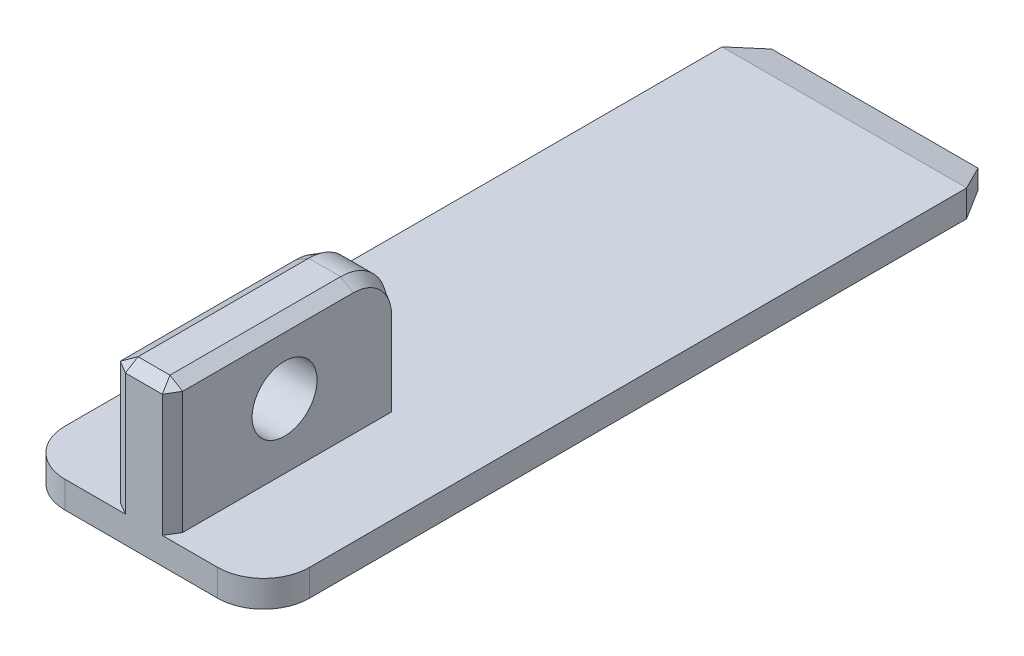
from build123d import *
from OCP.BRepFilletAPI import BRepFilletAPI_MakeChamfer

# Parameters (mm, degrees)
SKIZZE1_W                       = 32
SKIZZE1_H                       = 3.5
AUFSATZ_LINEAR_AUSTRAGEN1_DEPTH = 96
FASE1_SIZE                      = 2.5
FASE1_SIZE2                     = 4
FASE2_SIZE                      = 1
FASE2_SIZE2                     = 4
SKIZZE2_W                       = 7.5
SKIZZE2_H                       = 30
AUFSATZ_LINEAR_AUSTRAGEN2_DEPTH = 17
SKIZZE3_R                       = 4.25
SCHNITT_LINEAR_AUSTRAGEN1_DEPTH = 100.787900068
VERRUNDUNG1_R                   = 6
VERRUNDUNG2_R                   = 6
FASE3_SIZE                      = 1
FASE3_SIZE2                     = 1.664279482


with BuildPart() as part:
    # Skizze1 → Aufsatz-Linear austragen1 (new body)
    with BuildSketch(Plane.XY):
        Rectangle(SKIZZE1_W, SKIZZE1_H)
    extrude(amount=AUFSATZ_LINEAR_AUSTRAGEN1_DEPTH)

    # Fase1
    fase1_edges = [part.edges().sort_by_distance(p)[0] for p in [
        (-16, 0, 0),
        (16, 0, 0),
    ]]
    fase1_side = [part.faces().sort_by_distance(p)[0] for p in [
        (0, 0, 0),
    ]]
    chamfer(fase1_edges, length=FASE1_SIZE, length2=FASE1_SIZE2, reference=fase1_side[0])

    # Fase2
    fase2_edges = [part.edges().sort_by_distance(p)[0] for p in [
        (0, 1.75, 0),
    ]]
    fase2_side = [part.faces().sort_by_distance(p)[0] for p in [
        (0, 0, 0),
    ]]
    chamfer(fase2_edges, length=FASE2_SIZE, length2=FASE2_SIZE2, reference=fase2_side[0])

    # Skizze2 → Aufsatz-Linear austragen2 (add)
    with BuildSketch(Plane(origin=(0, 1.75, 0), x_dir=(1, 0, 0), z_dir=(0, 1, 0))):
        with Locations((0, -81)):
            Rectangle(SKIZZE2_W, SKIZZE2_H)
    extrude(amount=AUFSATZ_LINEAR_AUSTRAGEN2_DEPTH)

    # Skizze3 → Schnitt-Linear austragen1 (cut, through all)
    with BuildSketch(Plane(origin=(3.75, 0, 0), x_dir=(0, 0, -1), z_dir=(1, 0, 0))):
        with Locations((-81, 10.25)):
            Circle(SKIZZE3_R)
    extrude(amount=-SCHNITT_LINEAR_AUSTRAGEN1_DEPTH, mode=Mode.SUBTRACT)

    # Verrundung1
    verrundung1_edges = [part.edges().sort_by_distance(p)[0] for p in [
        (0, 18.75, 66),
    ]]
    fillet(verrundung1_edges, radius=VERRUNDUNG1_R)

    # Verrundung2
    verrundung2_edges = [part.edges().sort_by_distance(p)[0] for p in [
        (-16, 0, 96),
        (16, 0, 96),
    ]]
    fillet(verrundung2_edges, radius=VERRUNDUNG2_R)

    # Fase3: one chamfer whose edges measure the first distance from different faces: ONE call of the kernel's chamfer builder (chamfer() names one face for all edges)
    fase3_edges_1 = [part.edges().sort_by_distance(p)[0] for p in [
        (-3.75, 10.25, 96),
        (-3.75, 18.75, 84),
        (-3.75, 7.25, 66),
        (-3.75, 16.992640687, 67.757359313),
    ]]
    fase3_side_1 = [part.faces().sort_by_distance(p)[0] for p in [
        (-3.75, 18.405181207, 84),
    ]]
    fase3_edges_2 = [part.edges().sort_by_distance(p)[0] for p in [
        (3.75, 10.25, 96),
        (0, 18.75, 96),
    ]]
    fase3_side_2 = [part.faces().sort_by_distance(p)[0] for p in [
        (0, 6.617088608, 96),
    ]]
    fase3_edges_3 = [part.edges().sort_by_distance(p)[0] for p in [
        (3.75, 18.75, 84),
        (3.75, 7.25, 66),
        (3.75, 16.992640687, 67.757359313),
    ]]
    fase3_side_3 = [part.faces().sort_by_distance(p)[0] for p in [
        (3.75, 7.25, 66.344818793),
    ]]
    fase3 = BRepFilletAPI_MakeChamfer(part.part.solid().wrapped)
    for e in fase3_edges_1:
        fase3.Add(FASE3_SIZE, FASE3_SIZE2, e.wrapped, fase3_side_1[0].wrapped)  # the first distance lies on this face
    for e in fase3_edges_2:
        fase3.Add(FASE3_SIZE, FASE3_SIZE2, e.wrapped, fase3_side_2[0].wrapped)  # the first distance lies on this face
    for e in fase3_edges_3:
        fase3.Add(FASE3_SIZE, FASE3_SIZE2, e.wrapped, fase3_side_3[0].wrapped)  # the first distance lies on this face
    add(Compound.cast(fase3.Shape()), mode=Mode.REPLACE)


solid = part.part
